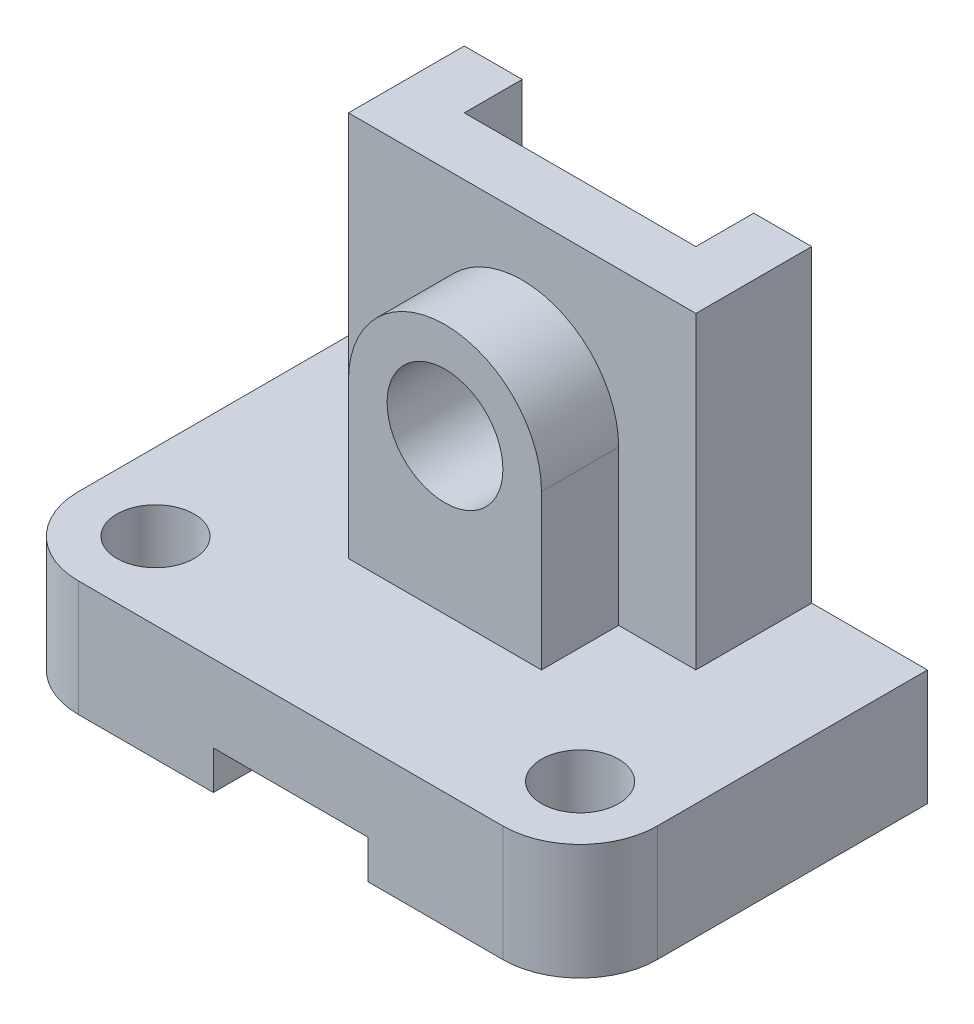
ISO-10303-21;
HEADER;
FILE_DESCRIPTION(('STEP AP214'),'2;1');
FILE_NAME('part.step','',(''),(''),'','','');
FILE_SCHEMA(('AUTOMOTIVE_DESIGN { 1 0 10303 214 1 1 1 1 }'));
ENDSEC;
DATA;
#1=APPLICATION_CONTEXT('core data for automotive mechanical design processes');
#2=APPLICATION_PROTOCOL_DEFINITION('international standard','automotive_design',2000,#1);
#3=PRODUCT_CONTEXT('',#1,'mechanical');
#4=PRODUCT('Part','Part','',(#3));
#5=PRODUCT_RELATED_PRODUCT_CATEGORY('part','',(#4));
#6=PRODUCT_DEFINITION_FORMATION('','',#4);
#7=PRODUCT_DEFINITION_CONTEXT('part definition',#1,'design');
#8=PRODUCT_DEFINITION('design','',#6,#7);
#9=PRODUCT_DEFINITION_SHAPE('','',#8);
#10=(LENGTH_UNIT() NAMED_UNIT(*) SI_UNIT(.MILLI.,.METRE.));
#11=(NAMED_UNIT(*) PLANE_ANGLE_UNIT() SI_UNIT($,.RADIAN.));
#12=(NAMED_UNIT(*) SI_UNIT($,.STERADIAN.) SOLID_ANGLE_UNIT());
#13=UNCERTAINTY_MEASURE_WITH_UNIT(LENGTH_MEASURE(1.E-05),#10,'distance_accuracy_value','');
#14=(GEOMETRIC_REPRESENTATION_CONTEXT(3) GLOBAL_UNCERTAINTY_ASSIGNED_CONTEXT((#13)) GLOBAL_UNIT_ASSIGNED_CONTEXT((#10,
#11,#12)) REPRESENTATION_CONTEXT('',''));
#15=CARTESIAN_POINT('',(0.,0.,0.));
#16=DIRECTION('',(0.,0.,1.));
#17=DIRECTION('',(1.,0.,0.));
#18=AXIS2_PLACEMENT_3D('',#15,#16,#17);
#19=CARTESIAN_POINT('',(-11.,-6.,21.1198350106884));
#20=DIRECTION('',(0.,-1.,0.));
#21=DIRECTION('',(0.,0.,-1.));
#22=AXIS2_PLACEMENT_3D('',#19,#20,#21);
#23=PLANE('',#22);
#24=DIRECTION('',(0.,0.,-1.));
#25=VECTOR('',#24,1.);
#26=CARTESIAN_POINT('',(-4.,-6.,21.1198350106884));
#27=LINE('',#26,#25);
#28=CARTESIAN_POINT('',(-4.,-6.,25.1198350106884));
#29=VERTEX_POINT('',#28);
#30=CARTESIAN_POINT('',(-4.,-6.,10.1198350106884));
#31=VERTEX_POINT('',#30);
#32=EDGE_CURVE('E11',#29,#31,#27,.T.);
#33=ORIENTED_EDGE('',*,*,#32,.F.);
#34=DIRECTION('',(1.,0.,0.));
#35=VECTOR('',#34,1.);
#36=CARTESIAN_POINT('',(-11.,-6.,25.1198350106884));
#37=LINE('',#36,#35);
#38=CARTESIAN_POINT('',(-11.,-6.,25.1198350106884));
#39=VERTEX_POINT('',#38);
#40=EDGE_CURVE('E196',#39,#29,#37,.T.);
#41=ORIENTED_EDGE('',*,*,#40,.F.);
#42=CARTESIAN_POINT('',(-11.,-6.,21.1198350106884));
#43=DIRECTION('',(0.,1.,0.));
#44=DIRECTION('',(0.,0.,-1.));
#45=AXIS2_PLACEMENT_3D('',#42,#43,#44);
#46=CIRCLE('',#45,4.);
#47=CARTESIAN_POINT('',(-15.,-6.,21.1198350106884));
#48=VERTEX_POINT('',#47);
#49=EDGE_CURVE('E209',#48,#39,#46,.T.);
#50=ORIENTED_EDGE('',*,*,#49,.F.);
#51=DIRECTION('',(0.,0.,1.));
#52=VECTOR('',#51,1.);
#53=CARTESIAN_POINT('',(-15.,-6.,7.11983501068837));
#54=LINE('',#53,#52);
#55=CARTESIAN_POINT('',(-15.,-6.,7.11983501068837));
#56=VERTEX_POINT('',#55);
#57=EDGE_CURVE('E258',#56,#48,#54,.T.);
#58=ORIENTED_EDGE('',*,*,#57,.F.);
#59=DIRECTION('',(-1.,0.,0.));
#60=VECTOR('',#59,1.);
#61=CARTESIAN_POINT('',(-15.,-6.,7.11983501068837));
#62=LINE('',#61,#60);
#63=CARTESIAN_POINT('',(-6.,-6.,7.11983501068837));
#64=VERTEX_POINT('',#63);
#65=EDGE_CURVE('E227',#64,#56,#62,.T.);
#66=ORIENTED_EDGE('',*,*,#65,.F.);
#67=DIRECTION('',(0.,0.,-1.));
#68=VECTOR('',#67,1.);
#69=CARTESIAN_POINT('',(-6.,-6.,7.11983501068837));
#70=LINE('',#69,#68);
#71=CARTESIAN_POINT('',(-5.99999999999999,-6.,10.1198350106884));
#72=VERTEX_POINT('',#71);
#73=EDGE_CURVE('E224',#72,#64,#70,.T.);
#74=ORIENTED_EDGE('',*,*,#73,.F.);
#75=DIRECTION('',(-1.,0.,0.));
#76=VECTOR('',#75,1.);
#77=CARTESIAN_POINT('',(-5.99999999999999,-6.,10.1198350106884));
#78=LINE('',#77,#76);
#79=EDGE_CURVE('E199',#31,#72,#78,.T.);
#80=ORIENTED_EDGE('',*,*,#79,.F.);
#81=EDGE_LOOP('',(#33,#41,#50,#58,#66,#74,#80));
#82=FACE_BOUND('',#81,.T.);
#83=CARTESIAN_POINT('',(-11.,-6.,21.1198350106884));
#84=DIRECTION('',(0.,1.,0.));
#85=DIRECTION('',(0.,0.,1.));
#86=AXIS2_PLACEMENT_3D('',#83,#84,#85);
#87=CIRCLE('',#86,2.);
#88=CARTESIAN_POINT('',(-11.,-6.,23.1198350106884));
#89=VERTEX_POINT('',#88);
#90=EDGE_CURVE('E235',#89,#89,#87,.T.);
#91=ORIENTED_EDGE('',*,*,#90,.T.);
#92=EDGE_LOOP('',(#91));
#93=FACE_BOUND('',#92,.T.);
#94=ADVANCED_FACE('F31',(#82,#93),#23,.T.);
#95=CARTESIAN_POINT('',(-5.99999999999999,-6.,10.1198350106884));
#96=DIRECTION('',(0.,0.,-1.));
#97=DIRECTION('',(-1.,0.,0.));
#98=AXIS2_PLACEMENT_3D('',#95,#96,#97);
#99=PLANE('',#98);
#100=DIRECTION('',(0.,1.,0.));
#101=VECTOR('',#100,1.);
#102=CARTESIAN_POINT('',(-4.,-6.,10.1198350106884));
#103=LINE('',#102,#101);
#104=CARTESIAN_POINT('',(-4.,-4.,10.1198350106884));
#105=VERTEX_POINT('',#104);
#106=EDGE_CURVE('E435',#31,#105,#103,.T.);
#107=ORIENTED_EDGE('',*,*,#106,.F.);
#108=ORIENTED_EDGE('',*,*,#79,.T.);
#109=DIRECTION('',(0.,1.,0.));
#110=VECTOR('',#109,1.);
#111=CARTESIAN_POINT('',(-5.99999999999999,-6.,10.1198350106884));
#112=LINE('',#111,#110);
#113=CARTESIAN_POINT('',(-5.99999999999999,16.,10.1198350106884));
#114=VERTEX_POINT('',#113);
#115=EDGE_CURVE('E319',#72,#114,#112,.T.);
#116=ORIENTED_EDGE('',*,*,#115,.T.);
#117=DIRECTION('',(-1.,0.,0.));
#118=VECTOR('',#117,1.);
#119=CARTESIAN_POINT('',(5.99999999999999,16.,10.1198350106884));
#120=LINE('',#119,#118);
#121=CARTESIAN_POINT('',(5.99999999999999,16.,10.1198350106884));
#122=VERTEX_POINT('',#121);
#123=EDGE_CURVE('E358',#122,#114,#120,.T.);
#124=ORIENTED_EDGE('',*,*,#123,.F.);
#125=DIRECTION('',(0.,1.,0.));
#126=VECTOR('',#125,1.);
#127=CARTESIAN_POINT('',(5.99999999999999,-6.,10.1198350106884));
#128=LINE('',#127,#126);
#129=CARTESIAN_POINT('',(5.99999999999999,-6.,10.1198350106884));
#130=VERTEX_POINT('',#129);
#131=EDGE_CURVE('E326',#130,#122,#128,.T.);
#132=ORIENTED_EDGE('',*,*,#131,.F.);
#133=CARTESIAN_POINT('',(4.,-6.,10.1198350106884));
#134=VERTEX_POINT('',#133);
#135=EDGE_CURVE('E221',#130,#134,#78,.T.);
#136=ORIENTED_EDGE('',*,*,#135,.T.);
#137=DIRECTION('',(0.,-1.,0.));
#138=VECTOR('',#137,1.);
#139=CARTESIAN_POINT('',(4.,-6.,10.1198350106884));
#140=LINE('',#139,#138);
#141=CARTESIAN_POINT('',(4.,-4.,10.1198350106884));
#142=VERTEX_POINT('',#141);
#143=EDGE_CURVE('E46',#142,#134,#140,.T.);
#144=ORIENTED_EDGE('',*,*,#143,.F.);
#145=DIRECTION('',(1.,0.,0.));
#146=VECTOR('',#145,1.);
#147=CARTESIAN_POINT('',(-5.99999999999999,-4.,10.1198350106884));
#148=LINE('',#147,#146);
#149=EDGE_CURVE('E433',#105,#142,#148,.T.);
#150=ORIENTED_EDGE('',*,*,#149,.F.);
#151=EDGE_LOOP('',(#107,#108,#116,#124,#132,#136,#144,#150));
#152=FACE_BOUND('',#151,.T.);
#153=CARTESIAN_POINT('',(0.,8.,10.1198350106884));
#154=DIRECTION('',(0.,0.,-1.));
#155=DIRECTION('',(-1.,0.,0.));
#156=AXIS2_PLACEMENT_3D('',#153,#154,#155);
#157=CIRCLE('',#156,3.);
#158=CARTESIAN_POINT('',(-3.,8.,10.1198350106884));
#159=VERTEX_POINT('',#158);
#160=EDGE_CURVE('E406',#159,#159,#157,.F.);
#161=ORIENTED_EDGE('',*,*,#160,.T.);
#162=EDGE_LOOP('',(#161));
#163=FACE_BOUND('',#162,.T.);
#164=ADVANCED_FACE('F450',(#152,#163),#99,.T.);
#165=CARTESIAN_POINT('',(0.,8.,17.1198350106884));
#166=DIRECTION('',(0.,0.,1.));
#167=DIRECTION('',(1.,0.,0.));
#168=AXIS2_PLACEMENT_3D('',#165,#166,#167);
#169=PLANE('',#168);
#170=CARTESIAN_POINT('',(0.,8.,17.1198350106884));
#171=DIRECTION('',(0.,0.,1.));
#172=DIRECTION('',(1.,0.,0.));
#173=AXIS2_PLACEMENT_3D('',#170,#171,#172);
#174=CIRCLE('',#173,5.);
#175=CARTESIAN_POINT('',(5.,8.,17.1198350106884));
#176=VERTEX_POINT('',#175);
#177=CARTESIAN_POINT('',(-5.,8.,17.1198350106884));
#178=VERTEX_POINT('',#177);
#179=EDGE_CURVE('E404',#176,#178,#174,.T.);
#180=ORIENTED_EDGE('',*,*,#179,.T.);
#181=DIRECTION('',(0.,-1.,0.));
#182=VECTOR('',#181,1.);
#183=CARTESIAN_POINT('',(-5.,8.,17.1198350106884));
#184=LINE('',#183,#182);
#185=CARTESIAN_POINT('',(-5.,0.,17.1198350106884));
#186=VERTEX_POINT('',#185);
#187=EDGE_CURVE('E425',#178,#186,#184,.T.);
#188=ORIENTED_EDGE('',*,*,#187,.T.);
#189=DIRECTION('',(1.,0.,0.));
#190=VECTOR('',#189,1.);
#191=CARTESIAN_POINT('',(-5.,0.,17.1198350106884));
#192=LINE('',#191,#190);
#193=CARTESIAN_POINT('',(5.,0.,17.1198350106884));
#194=VERTEX_POINT('',#193);
#195=EDGE_CURVE('E54',#186,#194,#192,.T.);
#196=ORIENTED_EDGE('',*,*,#195,.T.);
#197=DIRECTION('',(0.,1.,0.));
#198=VECTOR('',#197,1.);
#199=CARTESIAN_POINT('',(5.,0.,17.1198350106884));
#200=LINE('',#199,#198);
#201=EDGE_CURVE('E414',#194,#176,#200,.T.);
#202=ORIENTED_EDGE('',*,*,#201,.T.);
#203=EDGE_LOOP('',(#180,#188,#196,#202));
#204=FACE_BOUND('',#203,.T.);
#205=CARTESIAN_POINT('',(0.,8.,17.1198350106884));
#206=DIRECTION('',(0.,0.,1.));
#207=DIRECTION('',(1.,0.,0.));
#208=AXIS2_PLACEMENT_3D('',#205,#206,#207);
#209=CIRCLE('',#208,3.);
#210=CARTESIAN_POINT('',(3.,8.,17.1198350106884));
#211=VERTEX_POINT('',#210);
#212=EDGE_CURVE('E432',#211,#211,#209,.F.);
#213=ORIENTED_EDGE('',*,*,#212,.T.);
#214=EDGE_LOOP('',(#213));
#215=FACE_BOUND('',#214,.T.);
#216=ADVANCED_FACE('F423',(#204,#215),#169,.T.);
#217=CARTESIAN_POINT('',(-11.,0.,21.1198350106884));
#218=DIRECTION('',(0.,-1.,0.));
#219=DIRECTION('',(0.,0.,-1.));
#220=AXIS2_PLACEMENT_3D('',#217,#218,#219);
#221=PLANE('',#220);
#222=CARTESIAN_POINT('',(11.,0.,21.1198350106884));
#223=DIRECTION('',(0.,1.,0.));
#224=DIRECTION('',(0.,0.,1.));
#225=AXIS2_PLACEMENT_3D('',#222,#223,#224);
#226=CIRCLE('',#225,2.);
#227=CARTESIAN_POINT('',(11.,0.,23.1198350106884));
#228=VERTEX_POINT('',#227);
#229=EDGE_CURVE('E269',#228,#228,#226,.T.);
#230=ORIENTED_EDGE('',*,*,#229,.F.);
#231=EDGE_LOOP('',(#230));
#232=FACE_BOUND('',#231,.T.);
#233=CARTESIAN_POINT('',(-11.,0.,21.1198350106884));
#234=DIRECTION('',(0.,1.,0.));
#235=DIRECTION('',(0.,0.,1.));
#236=AXIS2_PLACEMENT_3D('',#233,#234,#235);
#237=CIRCLE('',#236,2.);
#238=CARTESIAN_POINT('',(-11.,0.,23.1198350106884));
#239=VERTEX_POINT('',#238);
#240=EDGE_CURVE('E293',#239,#239,#237,.T.);
#241=ORIENTED_EDGE('',*,*,#240,.F.);
#242=EDGE_LOOP('',(#241));
#243=FACE_BOUND('',#242,.T.);
#244=DIRECTION('',(0.,0.,-1.));
#245=VECTOR('',#244,1.);
#246=CARTESIAN_POINT('',(-5.,0.,17.1198350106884));
#247=LINE('',#246,#245);
#248=CARTESIAN_POINT('',(-5.,0.,13.1198350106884));
#249=VERTEX_POINT('',#248);
#250=EDGE_CURVE('E399',#186,#249,#247,.T.);
#251=ORIENTED_EDGE('',*,*,#250,.T.);
#252=DIRECTION('',(1.,0.,0.));
#253=VECTOR('',#252,1.);
#254=CARTESIAN_POINT('',(-8.99999999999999,0.,13.1198350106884));
#255=LINE('',#254,#253);
#256=CARTESIAN_POINT('',(-8.99999999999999,0.,13.1198350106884));
#257=VERTEX_POINT('',#256);
#258=EDGE_CURVE('E278',#257,#249,#255,.T.);
#259=ORIENTED_EDGE('',*,*,#258,.F.);
#260=DIRECTION('',(0.,0.,1.));
#261=VECTOR('',#260,1.);
#262=CARTESIAN_POINT('',(-8.99999999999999,0.,7.11983501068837));
#263=LINE('',#262,#261);
#264=CARTESIAN_POINT('',(-8.99999999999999,0.,7.11983501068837));
#265=VERTEX_POINT('',#264);
#266=EDGE_CURVE('E259',#265,#257,#263,.T.);
#267=ORIENTED_EDGE('',*,*,#266,.F.);
#268=DIRECTION('',(-1.,0.,0.));
#269=VECTOR('',#268,1.);
#270=CARTESIAN_POINT('',(-15.,0.,7.11983501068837));
#271=LINE('',#270,#269);
#272=CARTESIAN_POINT('',(-15.,0.,7.11983501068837));
#273=VERTEX_POINT('',#272);
#274=EDGE_CURVE('E255',#265,#273,#271,.T.);
#275=ORIENTED_EDGE('',*,*,#274,.T.);
#276=DIRECTION('',(0.,0.,1.));
#277=VECTOR('',#276,1.);
#278=CARTESIAN_POINT('',(-15.,0.,7.11983501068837));
#279=LINE('',#278,#277);
#280=CARTESIAN_POINT('',(-15.,0.,21.1198350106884));
#281=VERTEX_POINT('',#280);
#282=EDGE_CURVE('E231',#273,#281,#279,.T.);
#283=ORIENTED_EDGE('',*,*,#282,.T.);
#284=CARTESIAN_POINT('',(-11.,0.,21.1198350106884));
#285=DIRECTION('',(0.,1.,0.));
#286=DIRECTION('',(0.,0.,-1.));
#287=AXIS2_PLACEMENT_3D('',#284,#285,#286);
#288=CIRCLE('',#287,4.);
#289=CARTESIAN_POINT('',(-11.,0.,25.1198350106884));
#290=VERTEX_POINT('',#289);
#291=EDGE_CURVE('E234',#281,#290,#288,.T.);
#292=ORIENTED_EDGE('',*,*,#291,.T.);
#293=DIRECTION('',(1.,0.,0.));
#294=VECTOR('',#293,1.);
#295=CARTESIAN_POINT('',(-11.,0.,25.1198350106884));
#296=LINE('',#295,#294);
#297=CARTESIAN_POINT('',(11.,0.,25.1198350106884));
#298=VERTEX_POINT('',#297);
#299=EDGE_CURVE('E238',#290,#298,#296,.T.);
#300=ORIENTED_EDGE('',*,*,#299,.T.);
#301=CARTESIAN_POINT('',(11.,0.,21.1198350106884));
#302=DIRECTION('',(0.,1.,0.));
#303=DIRECTION('',(0.,0.,1.));
#304=AXIS2_PLACEMENT_3D('',#301,#302,#303);
#305=CIRCLE('',#304,4.);
#306=CARTESIAN_POINT('',(15.,0.,21.1198350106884));
#307=VERTEX_POINT('',#306);
#308=EDGE_CURVE('E241',#298,#307,#305,.T.);
#309=ORIENTED_EDGE('',*,*,#308,.T.);
#310=DIRECTION('',(0.,0.,-1.));
#311=VECTOR('',#310,1.);
#312=CARTESIAN_POINT('',(15.,0.,7.11983501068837));
#313=LINE('',#312,#311);
#314=CARTESIAN_POINT('',(15.,0.,7.11983501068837));
#315=VERTEX_POINT('',#314);
#316=EDGE_CURVE('E244',#307,#315,#313,.T.);
#317=ORIENTED_EDGE('',*,*,#316,.T.);
#318=DIRECTION('',(-1.,0.,0.));
#319=VECTOR('',#318,1.);
#320=CARTESIAN_POINT('',(15.,0.,7.11983501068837));
#321=LINE('',#320,#319);
#322=CARTESIAN_POINT('',(8.99999999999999,0.,7.11983501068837));
#323=VERTEX_POINT('',#322);
#324=EDGE_CURVE('E247',#315,#323,#321,.T.);
#325=ORIENTED_EDGE('',*,*,#324,.T.);
#326=DIRECTION('',(0.,0.,-1.));
#327=VECTOR('',#326,1.);
#328=CARTESIAN_POINT('',(8.99999999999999,0.,7.11983501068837));
#329=LINE('',#328,#327);
#330=CARTESIAN_POINT('',(8.99999999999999,0.,13.1198350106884));
#331=VERTEX_POINT('',#330);
#332=EDGE_CURVE('E273',#331,#323,#329,.T.);
#333=ORIENTED_EDGE('',*,*,#332,.F.);
#334=CARTESIAN_POINT('',(5.,0.,13.1198350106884));
#335=VERTEX_POINT('',#334);
#336=EDGE_CURVE('E262',#335,#331,#255,.T.);
#337=ORIENTED_EDGE('',*,*,#336,.F.);
#338=DIRECTION('',(0.,0.,-1.));
#339=VECTOR('',#338,1.);
#340=CARTESIAN_POINT('',(5.,0.,17.1198350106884));
#341=LINE('',#340,#339);
#342=EDGE_CURVE('E413',#194,#335,#341,.T.);
#343=ORIENTED_EDGE('',*,*,#342,.F.);
#344=ORIENTED_EDGE('',*,*,#195,.F.);
#345=EDGE_LOOP('',(#251,#259,#267,#275,#283,#292,#300,#309,#317,#325,#333,#337,#343,#344));
#346=FACE_BOUND('',#345,.T.);
#347=ADVANCED_FACE('F337',(#232,#243,#346),#221,.F.);
#348=CARTESIAN_POINT('',(-8.99999999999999,16.,13.1198350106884));
#349=DIRECTION('',(0.,0.,-1.));
#350=DIRECTION('',(-1.,0.,0.));
#351=AXIS2_PLACEMENT_3D('',#348,#349,#350);
#352=PLANE('',#351);
#353=DIRECTION('',(0.,-1.,0.));
#354=VECTOR('',#353,1.);
#355=CARTESIAN_POINT('',(-5.,8.,13.1198350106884));
#356=LINE('',#355,#354);
#357=CARTESIAN_POINT('',(-5.,8.,13.1198350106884));
#358=VERTEX_POINT('',#357);
#359=EDGE_CURVE('E394',#358,#249,#356,.T.);
#360=ORIENTED_EDGE('',*,*,#359,.F.);
#361=CARTESIAN_POINT('',(0.,8.,13.1198350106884));
#362=DIRECTION('',(0.,0.,1.));
#363=DIRECTION('',(1.,0.,0.));
#364=AXIS2_PLACEMENT_3D('',#361,#362,#363);
#365=CIRCLE('',#364,5.);
#366=CARTESIAN_POINT('',(5.,8.,13.1198350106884));
#367=VERTEX_POINT('',#366);
#368=EDGE_CURVE('E402',#367,#358,#365,.T.);
#369=ORIENTED_EDGE('',*,*,#368,.F.);
#370=DIRECTION('',(0.,1.,0.));
#371=VECTOR('',#370,1.);
#372=CARTESIAN_POINT('',(5.,0.,13.1198350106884));
#373=LINE('',#372,#371);
#374=EDGE_CURVE('E391',#335,#367,#373,.T.);
#375=ORIENTED_EDGE('',*,*,#374,.F.);
#376=ORIENTED_EDGE('',*,*,#336,.T.);
#377=DIRECTION('',(0.,-1.,0.));
#378=VECTOR('',#377,1.);
#379=CARTESIAN_POINT('',(8.99999999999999,16.,13.1198350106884));
#380=LINE('',#379,#378);
#381=CARTESIAN_POINT('',(8.99999999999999,16.,13.1198350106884));
#382=VERTEX_POINT('',#381);
#383=EDGE_CURVE('E285',#382,#331,#380,.T.);
#384=ORIENTED_EDGE('',*,*,#383,.F.);
#385=DIRECTION('',(1.,0.,0.));
#386=VECTOR('',#385,1.);
#387=CARTESIAN_POINT('',(-8.99999999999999,16.,13.1198350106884));
#388=LINE('',#387,#386);
#389=CARTESIAN_POINT('',(-8.99999999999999,16.,13.1198350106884));
#390=VERTEX_POINT('',#389);
#391=EDGE_CURVE('E345',#390,#382,#388,.T.);
#392=ORIENTED_EDGE('',*,*,#391,.F.);
#393=DIRECTION('',(0.,-1.,0.));
#394=VECTOR('',#393,1.);
#395=CARTESIAN_POINT('',(-8.99999999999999,16.,13.1198350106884));
#396=LINE('',#395,#394);
#397=EDGE_CURVE('E270',#390,#257,#396,.T.);
#398=ORIENTED_EDGE('',*,*,#397,.T.);
#399=ORIENTED_EDGE('',*,*,#258,.T.);
#400=EDGE_LOOP('',(#360,#369,#375,#376,#384,#392,#398,#399));
#401=FACE_BOUND('',#400,.T.);
#402=ADVANCED_FACE('F389',(#401),#352,.F.);
#403=CARTESIAN_POINT('',(-15.,-6.,7.11983501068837));
#404=DIRECTION('',(-1.,0.,0.));
#405=DIRECTION('',(0.,0.,1.));
#406=AXIS2_PLACEMENT_3D('',#403,#404,#405);
#407=PLANE('',#406);
#408=ORIENTED_EDGE('',*,*,#282,.F.);
#409=DIRECTION('',(0.,1.,0.));
#410=VECTOR('',#409,1.);
#411=CARTESIAN_POINT('',(-15.,-6.,7.11983501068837));
#412=LINE('',#411,#410);
#413=EDGE_CURVE('E310',#56,#273,#412,.T.);
#414=ORIENTED_EDGE('',*,*,#413,.F.);
#415=ORIENTED_EDGE('',*,*,#57,.T.);
#416=DIRECTION('',(0.,1.,0.));
#417=VECTOR('',#416,1.);
#418=CARTESIAN_POINT('',(-15.,-6.,21.1198350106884));
#419=LINE('',#418,#417);
#420=EDGE_CURVE('E230',#48,#281,#419,.T.);
#421=ORIENTED_EDGE('',*,*,#420,.T.);
#422=EDGE_LOOP('',(#408,#414,#415,#421));
#423=FACE_BOUND('',#422,.T.);
#424=ADVANCED_FACE('F33',(#423),#407,.T.);
#425=CARTESIAN_POINT('',(-15.,-6.,7.11983501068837));
#426=DIRECTION('',(0.,0.,-1.));
#427=DIRECTION('',(-1.,0.,0.));
#428=AXIS2_PLACEMENT_3D('',#425,#426,#427);
#429=PLANE('',#428);
#430=ORIENTED_EDGE('',*,*,#274,.F.);
#431=DIRECTION('',(0.,-1.,0.));
#432=VECTOR('',#431,1.);
#433=CARTESIAN_POINT('',(-8.99999999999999,16.,7.11983501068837));
#434=LINE('',#433,#432);
#435=CARTESIAN_POINT('',(-8.99999999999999,16.,7.11983501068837));
#436=VERTEX_POINT('',#435);
#437=EDGE_CURVE('E266',#436,#265,#434,.T.);
#438=ORIENTED_EDGE('',*,*,#437,.F.);
#439=DIRECTION('',(-1.,0.,0.));
#440=VECTOR('',#439,1.);
#441=CARTESIAN_POINT('',(-8.99999999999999,16.,7.11983501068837));
#442=LINE('',#441,#440);
#443=CARTESIAN_POINT('',(-6.,16.,7.11983501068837));
#444=VERTEX_POINT('',#443);
#445=EDGE_CURVE('E315',#444,#436,#442,.T.);
#446=ORIENTED_EDGE('',*,*,#445,.F.);
#447=DIRECTION('',(0.,1.,0.));
#448=VECTOR('',#447,1.);
#449=CARTESIAN_POINT('',(-6.,-6.,7.11983501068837));
#450=LINE('',#449,#448);
#451=EDGE_CURVE('E313',#64,#444,#450,.T.);
#452=ORIENTED_EDGE('',*,*,#451,.F.);
#453=ORIENTED_EDGE('',*,*,#65,.T.);
#454=ORIENTED_EDGE('',*,*,#413,.T.);
#455=EDGE_LOOP('',(#430,#438,#446,#452,#453,#454));
#456=FACE_BOUND('',#455,.T.);
#457=ADVANCED_FACE('F309',(#456),#429,.T.);
#458=CARTESIAN_POINT('',(-6.,-6.,7.11983501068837));
#459=DIRECTION('',(1.,0.,0.));
#460=DIRECTION('',(0.,0.,-1.));
#461=AXIS2_PLACEMENT_3D('',#458,#459,#460);
#462=PLANE('',#461);
#463=ORIENTED_EDGE('',*,*,#451,.T.);
#464=DIRECTION('',(0.,0.,-1.));
#465=VECTOR('',#464,1.);
#466=CARTESIAN_POINT('',(-5.99999999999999,16.,10.1198350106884));
#467=LINE('',#466,#465);
#468=EDGE_CURVE('E277',#114,#444,#467,.T.);
#469=ORIENTED_EDGE('',*,*,#468,.F.);
#470=ORIENTED_EDGE('',*,*,#115,.F.);
#471=ORIENTED_EDGE('',*,*,#73,.T.);
#472=EDGE_LOOP('',(#463,#469,#470,#471));
#473=FACE_BOUND('',#472,.T.);
#474=ADVANCED_FACE('F322',(#473),#462,.T.);
#475=CARTESIAN_POINT('',(6.,-6.,7.11983501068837));
#476=DIRECTION('',(-1.,0.,0.));
#477=DIRECTION('',(0.,0.,1.));
#478=AXIS2_PLACEMENT_3D('',#475,#476,#477);
#479=PLANE('',#478);
#480=ORIENTED_EDGE('',*,*,#131,.T.);
#481=DIRECTION('',(0.,0.,1.));
#482=VECTOR('',#481,1.);
#483=CARTESIAN_POINT('',(5.99999999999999,16.,10.1198350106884));
#484=LINE('',#483,#482);
#485=CARTESIAN_POINT('',(6.,16.,7.11983501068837));
#486=VERTEX_POINT('',#485);
#487=EDGE_CURVE('E356',#486,#122,#484,.T.);
#488=ORIENTED_EDGE('',*,*,#487,.F.);
#489=DIRECTION('',(0.,1.,0.));
#490=VECTOR('',#489,1.);
#491=CARTESIAN_POINT('',(6.,-6.,7.11983501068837));
#492=LINE('',#491,#490);
#493=CARTESIAN_POINT('',(6.,-6.,7.11983501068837));
#494=VERTEX_POINT('',#493);
#495=EDGE_CURVE('E328',#494,#486,#492,.T.);
#496=ORIENTED_EDGE('',*,*,#495,.F.);
#497=DIRECTION('',(0.,0.,1.));
#498=VECTOR('',#497,1.);
#499=CARTESIAN_POINT('',(6.,-6.,7.11983501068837));
#500=LINE('',#499,#498);
#501=EDGE_CURVE('E218',#494,#130,#500,.T.);
#502=ORIENTED_EDGE('',*,*,#501,.T.);
#503=EDGE_LOOP('',(#480,#488,#496,#502));
#504=FACE_BOUND('',#503,.T.);
#505=ADVANCED_FACE('F385',(#504),#479,.T.);
#506=CARTESIAN_POINT('',(15.,-6.,7.11983501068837));
#507=DIRECTION('',(0.,0.,-1.));
#508=DIRECTION('',(-1.,0.,0.));
#509=AXIS2_PLACEMENT_3D('',#506,#507,#508);
#510=PLANE('',#509);
#511=ORIENTED_EDGE('',*,*,#324,.F.);
#512=DIRECTION('',(0.,1.,0.));
#513=VECTOR('',#512,1.);
#514=CARTESIAN_POINT('',(15.,-6.,7.11983501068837));
#515=LINE('',#514,#513);
#516=CARTESIAN_POINT('',(15.,-6.,7.11983501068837));
#517=VERTEX_POINT('',#516);
#518=EDGE_CURVE('E332',#517,#315,#515,.T.);
#519=ORIENTED_EDGE('',*,*,#518,.F.);
#520=DIRECTION('',(-1.,0.,0.));
#521=VECTOR('',#520,1.);
#522=CARTESIAN_POINT('',(15.,-6.,7.11983501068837));
#523=LINE('',#522,#521);
#524=EDGE_CURVE('E215',#517,#494,#523,.T.);
#525=ORIENTED_EDGE('',*,*,#524,.T.);
#526=ORIENTED_EDGE('',*,*,#495,.T.);
#527=DIRECTION('',(-1.,0.,0.));
#528=VECTOR('',#527,1.);
#529=CARTESIAN_POINT('',(8.99999999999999,16.,7.11983501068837));
#530=LINE('',#529,#528);
#531=CARTESIAN_POINT('',(8.99999999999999,16.,7.11983501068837));
#532=VERTEX_POINT('',#531);
#533=EDGE_CURVE('E353',#532,#486,#530,.T.);
#534=ORIENTED_EDGE('',*,*,#533,.F.);
#535=DIRECTION('',(0.,-1.,0.));
#536=VECTOR('',#535,1.);
#537=CARTESIAN_POINT('',(8.99999999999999,16.,7.11983501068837));
#538=LINE('',#537,#536);
#539=EDGE_CURVE('E279',#532,#323,#538,.T.);
#540=ORIENTED_EDGE('',*,*,#539,.T.);
#541=EDGE_LOOP('',(#511,#519,#525,#526,#534,#540));
#542=FACE_BOUND('',#541,.T.);
#543=ADVANCED_FACE('F364',(#542),#510,.T.);
#544=CARTESIAN_POINT('',(15.,-6.,7.11983501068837));
#545=DIRECTION('',(1.,0.,0.));
#546=DIRECTION('',(0.,0.,-1.));
#547=AXIS2_PLACEMENT_3D('',#544,#545,#546);
#548=PLANE('',#547);
#549=ORIENTED_EDGE('',*,*,#316,.F.);
#550=DIRECTION('',(0.,1.,0.));
#551=VECTOR('',#550,1.);
#552=CARTESIAN_POINT('',(15.,-6.,21.1198350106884));
#553=LINE('',#552,#551);
#554=CARTESIAN_POINT('',(15.,-6.,21.1198350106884));
#555=VERTEX_POINT('',#554);
#556=EDGE_CURVE('E334',#555,#307,#553,.T.);
#557=ORIENTED_EDGE('',*,*,#556,.F.);
#558=DIRECTION('',(0.,0.,-1.));
#559=VECTOR('',#558,1.);
#560=CARTESIAN_POINT('',(15.,-6.,7.11983501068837));
#561=LINE('',#560,#559);
#562=EDGE_CURVE('E207',#555,#517,#561,.T.);
#563=ORIENTED_EDGE('',*,*,#562,.T.);
#564=ORIENTED_EDGE('',*,*,#518,.T.);
#565=EDGE_LOOP('',(#549,#557,#563,#564));
#566=FACE_BOUND('',#565,.T.);
#567=ADVANCED_FACE('F375',(#566),#548,.T.);
#568=CARTESIAN_POINT('',(11.,-6.,21.1198350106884));
#569=DIRECTION('',(0.,1.,0.));
#570=DIRECTION('',(0.,0.,1.));
#571=AXIS2_PLACEMENT_3D('',#568,#569,#570);
#572=CYLINDRICAL_SURFACE('',#571,4.);
#573=ORIENTED_EDGE('',*,*,#308,.F.);
#574=DIRECTION('',(0.,1.,0.));
#575=VECTOR('',#574,1.);
#576=CARTESIAN_POINT('',(11.,-6.,25.1198350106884));
#577=LINE('',#576,#575);
#578=CARTESIAN_POINT('',(11.,-6.,25.1198350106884));
#579=VERTEX_POINT('',#578);
#580=EDGE_CURVE('E336',#579,#298,#577,.T.);
#581=ORIENTED_EDGE('',*,*,#580,.F.);
#582=CARTESIAN_POINT('',(11.,-6.,21.1198350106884));
#583=DIRECTION('',(0.,1.,0.));
#584=DIRECTION('',(0.,0.,1.));
#585=AXIS2_PLACEMENT_3D('',#582,#583,#584);
#586=CIRCLE('',#585,4.);
#587=EDGE_CURVE('E203',#579,#555,#586,.T.);
#588=ORIENTED_EDGE('',*,*,#587,.T.);
#589=ORIENTED_EDGE('',*,*,#556,.T.);
#590=EDGE_LOOP('',(#573,#581,#588,#589));
#591=FACE_BOUND('',#590,.T.);
#592=ADVANCED_FACE('F488',(#591),#572,.T.);
#593=CARTESIAN_POINT('',(-11.,-6.,25.1198350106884));
#594=DIRECTION('',(0.,0.,1.));
#595=DIRECTION('',(1.,0.,0.));
#596=AXIS2_PLACEMENT_3D('',#593,#594,#595);
#597=PLANE('',#596);
#598=DIRECTION('',(0.,-1.,0.));
#599=VECTOR('',#598,1.);
#600=CARTESIAN_POINT('',(-4.,-4.,25.1198350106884));
#601=LINE('',#600,#599);
#602=CARTESIAN_POINT('',(-4.,-4.,25.1198350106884));
#603=VERTEX_POINT('',#602);
#604=EDGE_CURVE('E179',#603,#29,#601,.T.);
#605=ORIENTED_EDGE('',*,*,#604,.F.);
#606=DIRECTION('',(-1.,0.,0.));
#607=VECTOR('',#606,1.);
#608=CARTESIAN_POINT('',(4.,-4.,25.1198350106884));
#609=LINE('',#608,#607);
#610=CARTESIAN_POINT('',(4.,-4.,25.1198350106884));
#611=VERTEX_POINT('',#610);
#612=EDGE_CURVE('E440',#611,#603,#609,.T.);
#613=ORIENTED_EDGE('',*,*,#612,.F.);
#614=DIRECTION('',(0.,1.,0.));
#615=VECTOR('',#614,1.);
#616=CARTESIAN_POINT('',(4.,-4.,25.1198350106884));
#617=LINE('',#616,#615);
#618=CARTESIAN_POINT('',(4.,-6.,25.1198350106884));
#619=VERTEX_POINT('',#618);
#620=EDGE_CURVE('E189',#619,#611,#617,.T.);
#621=ORIENTED_EDGE('',*,*,#620,.F.);
#622=EDGE_CURVE('E204',#619,#579,#37,.T.);
#623=ORIENTED_EDGE('',*,*,#622,.T.);
#624=ORIENTED_EDGE('',*,*,#580,.T.);
#625=ORIENTED_EDGE('',*,*,#299,.F.);
#626=DIRECTION('',(0.,1.,0.));
#627=VECTOR('',#626,1.);
#628=CARTESIAN_POINT('',(-11.,-6.,25.1198350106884));
#629=LINE('',#628,#627);
#630=EDGE_CURVE('E202',#39,#290,#629,.T.);
#631=ORIENTED_EDGE('',*,*,#630,.F.);
#632=ORIENTED_EDGE('',*,*,#40,.T.);
#633=EDGE_LOOP('',(#605,#613,#621,#623,#624,#625,#631,#632));
#634=FACE_BOUND('',#633,.T.);
#635=ADVANCED_FACE('F200',(#634),#597,.T.);
#636=CARTESIAN_POINT('',(-11.,-6.,21.1198350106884));
#637=DIRECTION('',(0.,1.,0.));
#638=DIRECTION('',(0.,0.,1.));
#639=AXIS2_PLACEMENT_3D('',#636,#637,#638);
#640=CYLINDRICAL_SURFACE('',#639,4.);
#641=ORIENTED_EDGE('',*,*,#291,.F.);
#642=ORIENTED_EDGE('',*,*,#420,.F.);
#643=ORIENTED_EDGE('',*,*,#49,.T.);
#644=ORIENTED_EDGE('',*,*,#630,.T.);
#645=EDGE_LOOP('',(#641,#642,#643,#644));
#646=FACE_BOUND('',#645,.T.);
#647=ADVANCED_FACE('F304',(#646),#640,.T.);
#648=DIRECTION('',(0.,0.,1.));
#649=VECTOR('',#648,1.);
#650=CARTESIAN_POINT('',(4.,-6.,21.1198350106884));
#651=LINE('',#650,#649);
#652=EDGE_CURVE('E39',#134,#619,#651,.T.);
#653=ORIENTED_EDGE('',*,*,#652,.F.);
#654=ORIENTED_EDGE('',*,*,#135,.F.);
#655=ORIENTED_EDGE('',*,*,#501,.F.);
#656=ORIENTED_EDGE('',*,*,#524,.F.);
#657=ORIENTED_EDGE('',*,*,#562,.F.);
#658=ORIENTED_EDGE('',*,*,#587,.F.);
#659=ORIENTED_EDGE('',*,*,#622,.F.);
#660=EDGE_LOOP('',(#653,#654,#655,#656,#657,#658,#659));
#661=FACE_BOUND('',#660,.T.);
#662=CARTESIAN_POINT('',(11.,-6.,21.1198350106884));
#663=DIRECTION('',(0.,1.,0.));
#664=DIRECTION('',(0.,0.,1.));
#665=AXIS2_PLACEMENT_3D('',#662,#663,#664);
#666=CIRCLE('',#665,2.);
#667=CARTESIAN_POINT('',(11.,-6.,23.1198350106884));
#668=VERTEX_POINT('',#667);
#669=EDGE_CURVE('E290',#668,#668,#666,.T.);
#670=ORIENTED_EDGE('',*,*,#669,.T.);
#671=EDGE_LOOP('',(#670));
#672=FACE_BOUND('',#671,.T.);
#673=ADVANCED_FACE('F380',(#661,#672),#23,.T.);
#674=CARTESIAN_POINT('',(-11.,-6.,21.1198350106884));
#675=DIRECTION('',(0.,1.,0.));
#676=DIRECTION('',(0.,0.,1.));
#677=AXIS2_PLACEMENT_3D('',#674,#675,#676);
#678=CYLINDRICAL_SURFACE('',#677,2.);
#679=ORIENTED_EDGE('',*,*,#90,.F.);
#680=EDGE_LOOP('',(#679));
#681=FACE_BOUND('',#680,.T.);
#682=ORIENTED_EDGE('',*,*,#240,.T.);
#683=EDGE_LOOP('',(#682));
#684=FACE_BOUND('',#683,.T.);
#685=ADVANCED_FACE('F478',(#681,#684),#678,.F.);
#686=CARTESIAN_POINT('',(11.,-6.,21.1198350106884));
#687=DIRECTION('',(0.,1.,0.));
#688=DIRECTION('',(0.,0.,1.));
#689=AXIS2_PLACEMENT_3D('',#686,#687,#688);
#690=CYLINDRICAL_SURFACE('',#689,2.);
#691=ORIENTED_EDGE('',*,*,#669,.F.);
#692=EDGE_LOOP('',(#691));
#693=FACE_BOUND('',#692,.T.);
#694=ORIENTED_EDGE('',*,*,#229,.T.);
#695=EDGE_LOOP('',(#694));
#696=FACE_BOUND('',#695,.T.);
#697=ADVANCED_FACE('F483',(#693,#696),#690,.F.);
#698=CARTESIAN_POINT('',(-8.99999999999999,16.,7.11983501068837));
#699=DIRECTION('',(1.,0.,0.));
#700=DIRECTION('',(0.,0.,-1.));
#701=AXIS2_PLACEMENT_3D('',#698,#699,#700);
#702=PLANE('',#701);
#703=ORIENTED_EDGE('',*,*,#266,.T.);
#704=ORIENTED_EDGE('',*,*,#397,.F.);
#705=DIRECTION('',(0.,0.,1.));
#706=VECTOR('',#705,1.);
#707=CARTESIAN_POINT('',(-8.99999999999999,16.,7.11983501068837));
#708=LINE('',#707,#706);
#709=EDGE_CURVE('E342',#436,#390,#708,.T.);
#710=ORIENTED_EDGE('',*,*,#709,.F.);
#711=ORIENTED_EDGE('',*,*,#437,.T.);
#712=EDGE_LOOP('',(#703,#704,#710,#711));
#713=FACE_BOUND('',#712,.T.);
#714=ADVANCED_FACE('F340',(#713),#702,.F.);
#715=CARTESIAN_POINT('',(8.99999999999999,16.,7.11983501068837));
#716=DIRECTION('',(-1.,0.,0.));
#717=DIRECTION('',(0.,0.,1.));
#718=AXIS2_PLACEMENT_3D('',#715,#716,#717);
#719=PLANE('',#718);
#720=ORIENTED_EDGE('',*,*,#332,.T.);
#721=ORIENTED_EDGE('',*,*,#539,.F.);
#722=DIRECTION('',(0.,0.,-1.));
#723=VECTOR('',#722,1.);
#724=CARTESIAN_POINT('',(8.99999999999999,16.,7.11983501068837));
#725=LINE('',#724,#723);
#726=EDGE_CURVE('E347',#382,#532,#725,.T.);
#727=ORIENTED_EDGE('',*,*,#726,.F.);
#728=ORIENTED_EDGE('',*,*,#383,.T.);
#729=EDGE_LOOP('',(#720,#721,#727,#728));
#730=FACE_BOUND('',#729,.T.);
#731=ADVANCED_FACE('F367',(#730),#719,.F.);
#732=CARTESIAN_POINT('',(-6.,16.,7.11983501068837));
#733=DIRECTION('',(0.,-1.,0.));
#734=DIRECTION('',(0.,0.,-1.));
#735=AXIS2_PLACEMENT_3D('',#732,#733,#734);
#736=PLANE('',#735);
#737=ORIENTED_EDGE('',*,*,#468,.T.);
#738=ORIENTED_EDGE('',*,*,#445,.T.);
#739=ORIENTED_EDGE('',*,*,#709,.T.);
#740=ORIENTED_EDGE('',*,*,#391,.T.);
#741=ORIENTED_EDGE('',*,*,#726,.T.);
#742=ORIENTED_EDGE('',*,*,#533,.T.);
#743=ORIENTED_EDGE('',*,*,#487,.T.);
#744=ORIENTED_EDGE('',*,*,#123,.T.);
#745=EDGE_LOOP('',(#737,#738,#739,#740,#741,#742,#743,#744));
#746=FACE_BOUND('',#745,.T.);
#747=ADVANCED_FACE('F387',(#746),#736,.F.);
#748=CARTESIAN_POINT('',(0.,8.,17.1198350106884));
#749=DIRECTION('',(0.,0.,-1.));
#750=DIRECTION('',(-1.,0.,0.));
#751=AXIS2_PLACEMENT_3D('',#748,#749,#750);
#752=CYLINDRICAL_SURFACE('',#751,5.);
#753=ORIENTED_EDGE('',*,*,#368,.T.);
#754=DIRECTION('',(0.,0.,-1.));
#755=VECTOR('',#754,1.);
#756=CARTESIAN_POINT('',(-5.,8.,17.1198350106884));
#757=LINE('',#756,#755);
#758=EDGE_CURVE('E263',#178,#358,#757,.T.);
#759=ORIENTED_EDGE('',*,*,#758,.F.);
#760=ORIENTED_EDGE('',*,*,#179,.F.);
#761=DIRECTION('',(0.,0.,-1.));
#762=VECTOR('',#761,1.);
#763=CARTESIAN_POINT('',(5.,8.,17.1198350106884));
#764=LINE('',#763,#762);
#765=EDGE_CURVE('E410',#176,#367,#764,.T.);
#766=ORIENTED_EDGE('',*,*,#765,.T.);
#767=EDGE_LOOP('',(#753,#759,#760,#766));
#768=FACE_BOUND('',#767,.T.);
#769=ADVANCED_FACE('F545',(#768),#752,.T.);
#770=CARTESIAN_POINT('',(-5.,8.,17.1198350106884));
#771=DIRECTION('',(1.,0.,0.));
#772=DIRECTION('',(0.,1.,0.));
#773=AXIS2_PLACEMENT_3D('',#770,#771,#772);
#774=PLANE('',#773);
#775=ORIENTED_EDGE('',*,*,#359,.T.);
#776=ORIENTED_EDGE('',*,*,#250,.F.);
#777=ORIENTED_EDGE('',*,*,#187,.F.);
#778=ORIENTED_EDGE('',*,*,#758,.T.);
#779=EDGE_LOOP('',(#775,#776,#777,#778));
#780=FACE_BOUND('',#779,.T.);
#781=ADVANCED_FACE('F398',(#780),#774,.F.);
#782=CARTESIAN_POINT('',(5.,0.,17.1198350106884));
#783=DIRECTION('',(-1.,0.,0.));
#784=DIRECTION('',(0.,-1.,0.));
#785=AXIS2_PLACEMENT_3D('',#782,#783,#784);
#786=PLANE('',#785);
#787=ORIENTED_EDGE('',*,*,#374,.T.);
#788=ORIENTED_EDGE('',*,*,#765,.F.);
#789=ORIENTED_EDGE('',*,*,#201,.F.);
#790=ORIENTED_EDGE('',*,*,#342,.T.);
#791=EDGE_LOOP('',(#787,#788,#789,#790));
#792=FACE_BOUND('',#791,.T.);
#793=ADVANCED_FACE('F419',(#792),#786,.F.);
#794=CARTESIAN_POINT('',(0.,8.,24.));
#795=DIRECTION('',(0.,0.,-1.));
#796=DIRECTION('',(-1.,0.,0.));
#797=AXIS2_PLACEMENT_3D('',#794,#795,#796);
#798=CYLINDRICAL_SURFACE('',#797,3.);
#799=ORIENTED_EDGE('',*,*,#160,.F.);
#800=EDGE_LOOP('',(#799));
#801=FACE_BOUND('',#800,.T.);
#802=ORIENTED_EDGE('',*,*,#212,.F.);
#803=EDGE_LOOP('',(#802));
#804=FACE_BOUND('',#803,.T.);
#805=ADVANCED_FACE('F456',(#801,#804),#798,.F.);
#806=CARTESIAN_POINT('',(-4.,-4.,1.11983501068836));
#807=DIRECTION('',(-1.,0.,0.));
#808=DIRECTION('',(0.,0.,1.));
#809=AXIS2_PLACEMENT_3D('',#806,#807,#808);
#810=PLANE('',#809);
#811=ORIENTED_EDGE('',*,*,#106,.T.);
#812=DIRECTION('',(0.,0.,1.));
#813=VECTOR('',#812,1.);
#814=CARTESIAN_POINT('',(-4.,-4.,1.11983501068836));
#815=LINE('',#814,#813);
#816=EDGE_CURVE('E184',#105,#603,#815,.T.);
#817=ORIENTED_EDGE('',*,*,#816,.T.);
#818=ORIENTED_EDGE('',*,*,#604,.T.);
#819=ORIENTED_EDGE('',*,*,#32,.T.);
#820=EDGE_LOOP('',(#811,#817,#818,#819));
#821=FACE_BOUND('',#820,.T.);
#822=ADVANCED_FACE('F181',(#821),#810,.F.);
#823=CARTESIAN_POINT('',(4.,-4.,1.11983501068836));
#824=DIRECTION('',(0.,1.,0.));
#825=DIRECTION('',(0.,0.,1.));
#826=AXIS2_PLACEMENT_3D('',#823,#824,#825);
#827=PLANE('',#826);
#828=ORIENTED_EDGE('',*,*,#149,.T.);
#829=DIRECTION('',(0.,0.,1.));
#830=VECTOR('',#829,1.);
#831=CARTESIAN_POINT('',(4.,-4.,1.11983501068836));
#832=LINE('',#831,#830);
#833=EDGE_CURVE('E438',#142,#611,#832,.T.);
#834=ORIENTED_EDGE('',*,*,#833,.T.);
#835=ORIENTED_EDGE('',*,*,#612,.T.);
#836=ORIENTED_EDGE('',*,*,#816,.F.);
#837=EDGE_LOOP('',(#828,#834,#835,#836));
#838=FACE_BOUND('',#837,.T.);
#839=ADVANCED_FACE('F448',(#838),#827,.F.);
#840=CARTESIAN_POINT('',(4.,-4.,1.11983501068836));
#841=DIRECTION('',(1.,0.,0.));
#842=DIRECTION('',(0.,0.,-1.));
#843=AXIS2_PLACEMENT_3D('',#840,#841,#842);
#844=PLANE('',#843);
#845=ORIENTED_EDGE('',*,*,#143,.T.);
#846=ORIENTED_EDGE('',*,*,#652,.T.);
#847=ORIENTED_EDGE('',*,*,#620,.T.);
#848=ORIENTED_EDGE('',*,*,#833,.F.);
#849=EDGE_LOOP('',(#845,#846,#847,#848));
#850=FACE_BOUND('',#849,.T.);
#851=ADVANCED_FACE('F445',(#850),#844,.F.);
#852=CLOSED_SHELL('',(#94,#164,#216,#347,#402,#424,#457,#474,#505,#543,#567,#592,#635,#647,#673,
#685,#697,#714,#731,#747,#769,#781,#793,#805,#822,#839,#851));
#853=MANIFOLD_SOLID_BREP('B2',#852);
#854=ADVANCED_BREP_SHAPE_REPRESENTATION('',(#18,#853),#14);
#855=SHAPE_DEFINITION_REPRESENTATION(#9,#854);
ENDSEC;
END-ISO-10303-21;
